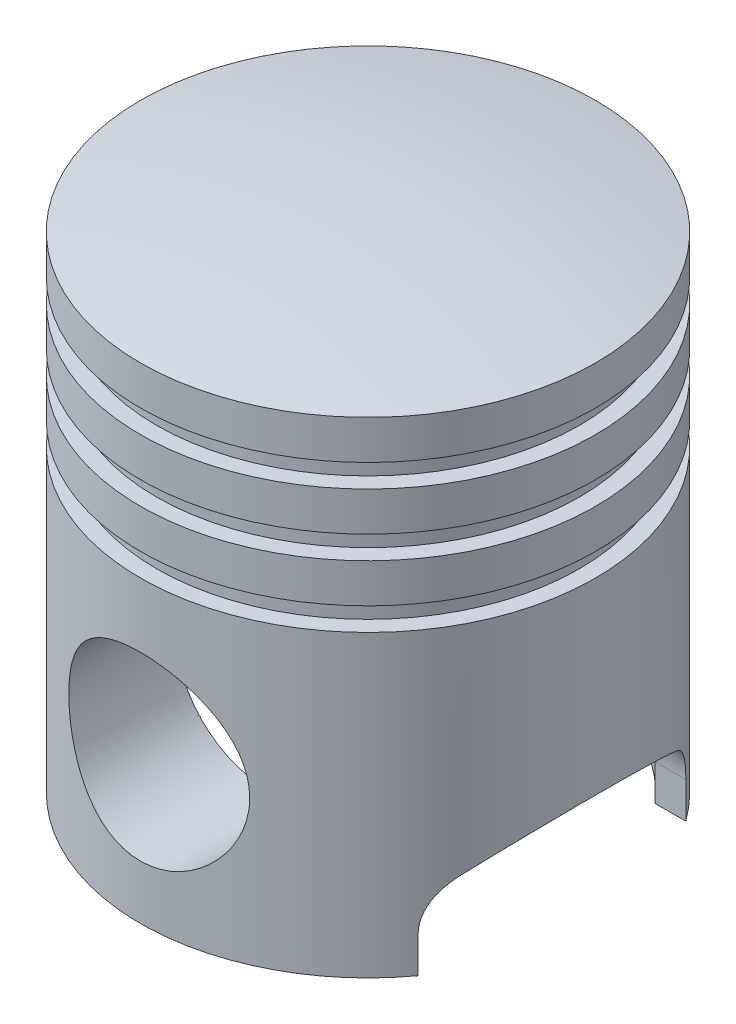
from build123d import *

# Parameters (mm, degrees)
CUT_EXTRUDE1_DEPTH       = 113.41663578
CUT_EXTRUDE1_DEPTH_BACK  = 113.41663578
SKETCH2_R                = 16.9
CUT_EXTRUDE2_DEPTH       = 113.416635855
CUT_EXTRUDE2_DEPTH_BACK  = 113.416635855
FILLET1_R                = 10
BOSS_EXTRUDE1_REACH      = 133.417
BOSS_EXTRUDE1_END_RADIUS = 38
BOSS_EXTRUDE1_START      = 19
SKETCH3_R                = 22.5
SKETCH3_R_2              = 16.9


with BuildPart() as part:
    # Sketch1 → Revolve2 (revolve)
    with BuildSketch(Plane.XY, mode=Mode.PRIVATE) as revolve2_sk:
        with BuildLine():
            Line((42.5, 90.7), (42.5, 83.4))
            Line((42.5, 83.4), (39.5, 83.4))
            Line((39.5, 83.4), (39.5, 79.1))
            Line((39.5, 79.1), (42.5, 79.1))
            Line((42.5, 79.1), (42.5, 71.8))
            Line((42.5, 71.8), (39.5, 71.8))
            Line((39.5, 71.8), (39.5, 67.5))
            Line((39.5, 67.5), (42.5, 67.5))
            Line((42.5, 67.5), (42.5, 60.2))
            Line((42.5, 60.2), (39.5, 60.2))
            Line((39.5, 60.2), (39.5, 55.9))
            Line((39.5, 55.9), (42.5, 55.9))
            Line((42.5, 55.9), (42.5, 0))
            Line((42.5, 0), (38, 0))
            Line((38, 0), (38, 85))
            Line((38, 85), (0, 85))
            Line((0, 85), (0, 95))
            ThreePointArc((0, 95), (21.358487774, 93.922262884), (42.5, 90.7))
        make_face()
    revolve(revolve2_sk.sketch.rotate(Axis((0, 85, 0), (0, 1, 0)), 90), axis=Axis((0, 85, 0), (0, 1, 0)))

    # Sketch2 → Cut-Extrude1 (cut, two sides: drawn at the far end of the back side and taken through both)
    with BuildSketch(Plane.XY.offset(-CUT_EXTRUDE1_DEPTH_BACK)):
        with Locations((0, 27)):
            Circle(SKETCH2_R)
    extrude(amount=CUT_EXTRUDE1_DEPTH + CUT_EXTRUDE1_DEPTH_BACK, mode=Mode.SUBTRACT)

    # Sketch4 → Cut-Extrude2 (cut, two sides: drawn at the far end of the back side and taken through both)
    with BuildSketch(Plane(origin=(0, 0, 0), x_dir=(0, 0, -1), z_dir=(1, 0, 0)).offset(-CUT_EXTRUDE2_DEPTH_BACK)):
        with BuildLine():
            Line((25, 12), (25, 0))
            Line((25, 0), (-25, 0))
            Line((-25, 0), (-25, 12))
            ThreePointArc((-25, 12), (0, 20.775010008), (25, 12))
        make_face()
    extrude(amount=CUT_EXTRUDE2_DEPTH + CUT_EXTRUDE2_DEPTH_BACK, mode=Mode.SUBTRACT)

    # Fillet1
    fillet1_edges = [part.edges().sort_by_distance(p)[0] for p in [
        (31.493746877, 12, -25),
        (-31.493746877, 12, -25),
        (-31.493746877, 12, 25),
        (31.493746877, 12, 25),
    ]]
    fillet(fillet1_edges, radius=FILLET1_R)

    # Boss-Extrude1: up to this cylinder (the profile starts inside it)
    boss_extrude1_end = Plane(origin=(0, 27, 0), z_dir=(0, -1, 0)) * Cylinder(BOSS_EXTRUDE1_END_RADIUS, 343.834, mode=Mode.PRIVATE)
    # Sketch3 → Boss-Extrude1 (add, up to the surface)
    with BuildSketch(Plane.XY.offset(BOSS_EXTRUDE1_START), mode=Mode.PRIVATE) as boss_extrude1_sk1:
        with Locations(Location((0, 27, 0), (0, 0, 180))):
            Circle(SKETCH3_R)
        with Locations((0, 27)):
            Circle(SKETCH3_R_2, mode=Mode.SUBTRACT)
    boss_extrude1_tool1 = extrude(boss_extrude1_sk1.sketch, amount=BOSS_EXTRUDE1_REACH, mode=Mode.PRIVATE) & boss_extrude1_end
    boss_extrude1 = boss_extrude1_tool1.solids().sort_by_distance((21.863604, 27, 19))[0]
    add(boss_extrude1)

    # Mirror1: Boss-Extrude1 across plane
    add(boss_extrude1.mirror(Plane.XY))


solid = part.part
